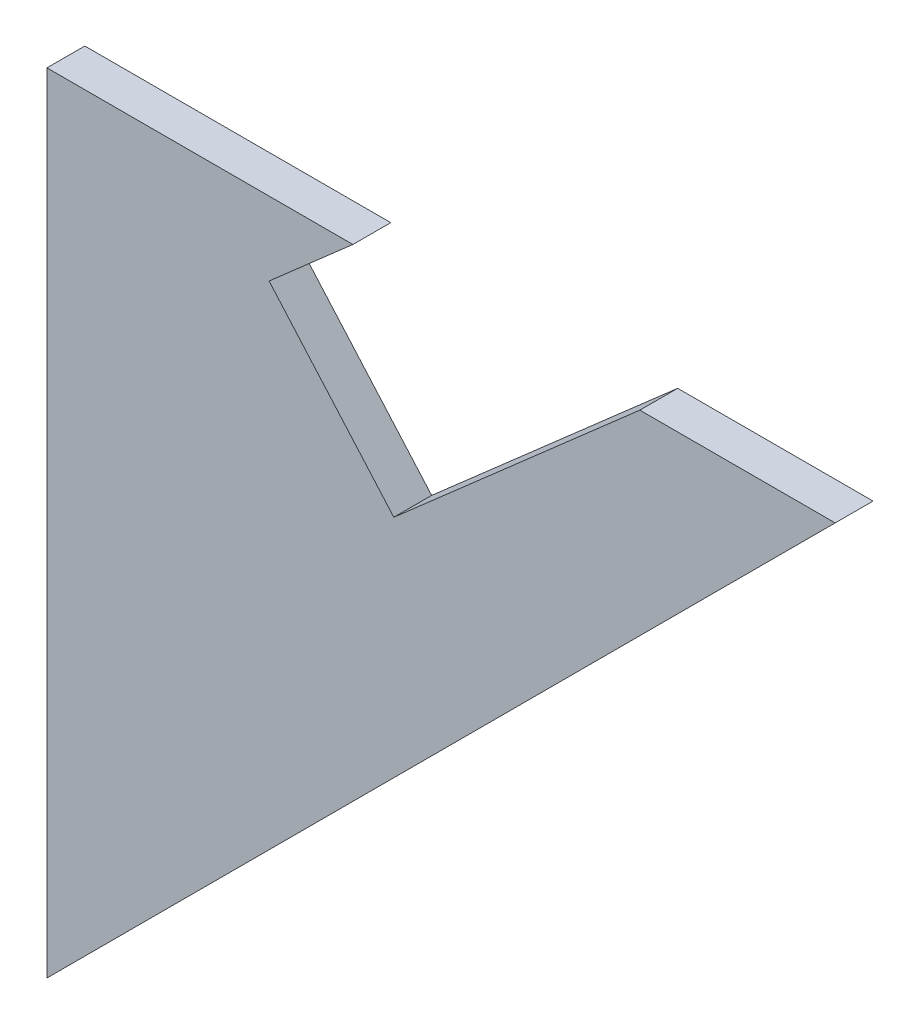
ISO-10303-21;
HEADER;
FILE_DESCRIPTION(('STEP AP214'),'2;1');
FILE_NAME('part.step','',(''),(''),'','','');
FILE_SCHEMA(('AUTOMOTIVE_DESIGN { 1 0 10303 214 1 1 1 1 }'));
ENDSEC;
DATA;
#1=APPLICATION_CONTEXT('core data for automotive mechanical design processes');
#2=APPLICATION_PROTOCOL_DEFINITION('international standard','automotive_design',2000,#1);
#3=PRODUCT_CONTEXT('',#1,'mechanical');
#4=PRODUCT('Part','Part','',(#3));
#5=PRODUCT_RELATED_PRODUCT_CATEGORY('part','',(#4));
#6=PRODUCT_DEFINITION_FORMATION('','',#4);
#7=PRODUCT_DEFINITION_CONTEXT('part definition',#1,'design');
#8=PRODUCT_DEFINITION('design','',#6,#7);
#9=PRODUCT_DEFINITION_SHAPE('','',#8);
#10=(LENGTH_UNIT() NAMED_UNIT(*) SI_UNIT(.MILLI.,.METRE.));
#11=(NAMED_UNIT(*) PLANE_ANGLE_UNIT() SI_UNIT($,.RADIAN.));
#12=(NAMED_UNIT(*) SI_UNIT($,.STERADIAN.) SOLID_ANGLE_UNIT());
#13=UNCERTAINTY_MEASURE_WITH_UNIT(LENGTH_MEASURE(1.E-05),#10,'distance_accuracy_value','');
#14=(GEOMETRIC_REPRESENTATION_CONTEXT(3) GLOBAL_UNCERTAINTY_ASSIGNED_CONTEXT((#13)) GLOBAL_UNIT_ASSIGNED_CONTEXT((#10,
#11,#12)) REPRESENTATION_CONTEXT('',''));
#15=CARTESIAN_POINT('',(0.,0.,0.));
#16=DIRECTION('',(0.,0.,1.));
#17=DIRECTION('',(1.,0.,0.));
#18=AXIS2_PLACEMENT_3D('',#15,#16,#17);
#19=CARTESIAN_POINT('',(110.00351767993,56.562232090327,36.001));
#20=DIRECTION('',(0.751859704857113,0.659323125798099,0.));
#21=DIRECTION('',(0.,0.,-1.));
#22=AXIS2_PLACEMENT_3D('',#19,#20,#21);
#23=PLANE('',#22);
#24=DIRECTION('',(0.,0.,-1.));
#25=VECTOR('',#24,1.);
#26=CARTESIAN_POINT('',(70.442811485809,101.67531810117,36.001));
#27=LINE('',#26,#25);
#28=CARTESIAN_POINT('',(70.442811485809,101.67531810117,12.));
#29=VERTEX_POINT('',#28);
#30=CARTESIAN_POINT('',(70.442811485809,101.67531810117,0.));
#31=VERTEX_POINT('',#30);
#32=EDGE_CURVE('E26',#29,#31,#27,.T.);
#33=ORIENTED_EDGE('',*,*,#32,.F.);
#34=DIRECTION('',(0.659323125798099,-0.751859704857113,0.));
#35=VECTOR('',#34,1.);
#36=CARTESIAN_POINT('',(110.25032063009,56.280790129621,12.));
#37=LINE('',#36,#35);
#38=CARTESIAN_POINT('',(110.00351767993,56.562232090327,12.));
#39=VERTEX_POINT('',#38);
#40=EDGE_CURVE('E90',#29,#39,#37,.T.);
#41=ORIENTED_EDGE('',*,*,#40,.T.);
#42=DIRECTION('',(0.,0.,-1.));
#43=VECTOR('',#42,1.);
#44=CARTESIAN_POINT('',(110.00351767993,56.562232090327,36.001));
#45=LINE('',#44,#43);
#46=CARTESIAN_POINT('',(110.00351767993,56.562232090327,0.));
#47=VERTEX_POINT('',#46);
#48=EDGE_CURVE('E10',#39,#47,#45,.T.);
#49=ORIENTED_EDGE('',*,*,#48,.T.);
#50=DIRECTION('',(0.659323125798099,-0.751859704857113,0.));
#51=VECTOR('',#50,1.);
#52=CARTESIAN_POINT('',(110.25032063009,56.280790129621,0.));
#53=LINE('',#52,#51);
#54=EDGE_CURVE('E87',#31,#47,#53,.T.);
#55=ORIENTED_EDGE('',*,*,#54,.F.);
#56=EDGE_LOOP('',(#33,#41,#49,#55));
#57=FACE_BOUND('',#56,.T.);
#58=ADVANCED_FACE('F16',(#57),#23,.T.);
#59=CARTESIAN_POINT('',(110.00351767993,56.562232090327,36.001));
#60=DIRECTION('',(-0.659323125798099,0.751859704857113,0.));
#61=DIRECTION('',(0.,0.,1.));
#62=AXIS2_PLACEMENT_3D('',#59,#60,#61);
#63=PLANE('',#62);
#64=ORIENTED_EDGE('',*,*,#48,.F.);
#65=DIRECTION('',(0.751859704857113,0.659323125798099,0.));
#66=VECTOR('',#65,1.);
#67=CARTESIAN_POINT('',(98.94912971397,46.86838418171,12.));
#68=LINE('',#67,#66);
#69=CARTESIAN_POINT('',(188.04658634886,125.,12.));
#70=VERTEX_POINT('',#69);
#71=EDGE_CURVE('E132',#39,#70,#68,.T.);
#72=ORIENTED_EDGE('',*,*,#71,.T.);
#73=DIRECTION('',(0.,0.,1.));
#74=VECTOR('',#73,1.);
#75=CARTESIAN_POINT('',(188.04658634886,125.,18.0005));
#76=LINE('',#75,#74);
#77=CARTESIAN_POINT('',(188.04658634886,125.,0.));
#78=VERTEX_POINT('',#77);
#79=EDGE_CURVE('E97',#78,#70,#76,.T.);
#80=ORIENTED_EDGE('',*,*,#79,.F.);
#81=DIRECTION('',(0.751859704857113,0.659323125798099,0.));
#82=VECTOR('',#81,1.);
#83=CARTESIAN_POINT('',(98.94912971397,46.86838418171,0.));
#84=LINE('',#83,#82);
#85=EDGE_CURVE('E95',#47,#78,#84,.T.);
#86=ORIENTED_EDGE('',*,*,#85,.F.);
#87=EDGE_LOOP('',(#64,#72,#80,#86));
#88=FACE_BOUND('',#87,.T.);
#89=ADVANCED_FACE('F18',(#88),#63,.T.);
#90=CARTESIAN_POINT('',(70.442811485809,101.67531810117,36.001));
#91=DIRECTION('',(-0.659323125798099,0.751859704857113,0.));
#92=DIRECTION('',(0.,0.,1.));
#93=AXIS2_PLACEMENT_3D('',#90,#91,#92);
#94=PLANE('',#93);
#95=DIRECTION('',(0.751859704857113,0.659323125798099,0.));
#96=VECTOR('',#95,1.);
#97=CARTESIAN_POINT('',(59.388423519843,91.981470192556,0.));
#98=LINE('',#97,#96);
#99=CARTESIAN_POINT('',(97.041132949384,125.,0.));
#100=VERTEX_POINT('',#99);
#101=EDGE_CURVE('E105',#31,#100,#98,.T.);
#102=ORIENTED_EDGE('',*,*,#101,.T.);
#103=DIRECTION('',(0.,0.,1.));
#104=VECTOR('',#103,1.);
#105=CARTESIAN_POINT('',(97.041132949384,125.,18.0005));
#106=LINE('',#105,#104);
#107=CARTESIAN_POINT('',(97.041132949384,125.,12.));
#108=VERTEX_POINT('',#107);
#109=EDGE_CURVE('E112',#100,#108,#106,.T.);
#110=ORIENTED_EDGE('',*,*,#109,.T.);
#111=DIRECTION('',(0.751859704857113,0.659323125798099,0.));
#112=VECTOR('',#111,1.);
#113=CARTESIAN_POINT('',(59.388423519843,91.981470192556,12.));
#114=LINE('',#113,#112);
#115=EDGE_CURVE('E149',#29,#108,#114,.T.);
#116=ORIENTED_EDGE('',*,*,#115,.F.);
#117=ORIENTED_EDGE('',*,*,#32,.T.);
#118=EDGE_LOOP('',(#102,#110,#116,#117));
#119=FACE_BOUND('',#118,.T.);
#120=ADVANCED_FACE('F185',(#119),#94,.F.);
#121=CARTESIAN_POINT('',(0.,125.,0.));
#122=DIRECTION('',(0.,1.,0.));
#123=DIRECTION('',(1.,0.,0.));
#124=AXIS2_PLACEMENT_3D('',#121,#122,#123);
#125=PLANE('',#124);
#126=DIRECTION('',(1.,0.,0.));
#127=VECTOR('',#126,1.);
#128=CARTESIAN_POINT('',(0.,125.,0.));
#129=LINE('',#128,#127);
#130=CARTESIAN_POINT('',(250.,125.,0.));
#131=VERTEX_POINT('',#130);
#132=EDGE_CURVE('E101',#78,#131,#129,.T.);
#133=ORIENTED_EDGE('',*,*,#132,.F.);
#134=ORIENTED_EDGE('',*,*,#79,.T.);
#135=DIRECTION('',(1.,0.,0.));
#136=VECTOR('',#135,1.);
#137=CARTESIAN_POINT('',(0.,125.,12.));
#138=LINE('',#137,#136);
#139=CARTESIAN_POINT('',(250.,125.,12.));
#140=VERTEX_POINT('',#139);
#141=EDGE_CURVE('E135',#70,#140,#138,.T.);
#142=ORIENTED_EDGE('',*,*,#141,.T.);
#143=DIRECTION('',(0.,0.,1.));
#144=VECTOR('',#143,1.);
#145=CARTESIAN_POINT('',(250.,125.,0.));
#146=LINE('',#145,#144);
#147=EDGE_CURVE('E122',#131,#140,#146,.T.);
#148=ORIENTED_EDGE('',*,*,#147,.F.);
#149=EDGE_LOOP('',(#133,#134,#142,#148));
#150=FACE_BOUND('',#149,.T.);
#151=ADVANCED_FACE('F154',(#150),#125,.T.);
#152=CARTESIAN_POINT('',(88.388347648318,36.611652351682,12.));
#153=DIRECTION('',(0.,0.,-1.));
#154=DIRECTION('',(0.,-1.,0.));
#155=AXIS2_PLACEMENT_3D('',#152,#153,#154);
#156=PLANE('',#155);
#157=ORIENTED_EDGE('',*,*,#141,.F.);
#158=ORIENTED_EDGE('',*,*,#71,.F.);
#159=ORIENTED_EDGE('',*,*,#40,.F.);
#160=ORIENTED_EDGE('',*,*,#115,.T.);
#161=DIRECTION('',(1.,0.,0.));
#162=VECTOR('',#161,1.);
#163=CARTESIAN_POINT('',(0.,125.,12.));
#164=LINE('',#163,#162);
#165=CARTESIAN_POINT('',(0.,125.,12.));
#166=VERTEX_POINT('',#165);
#167=EDGE_CURVE('E130',#166,#108,#164,.T.);
#168=ORIENTED_EDGE('',*,*,#167,.F.);
#169=DIRECTION('',(0.,1.,0.));
#170=VECTOR('',#169,1.);
#171=CARTESIAN_POINT('',(0.,-125.,12.));
#172=LINE('',#171,#170);
#173=CARTESIAN_POINT('',(0.,-125.,12.));
#174=VERTEX_POINT('',#173);
#175=EDGE_CURVE('E116',#174,#166,#172,.T.);
#176=ORIENTED_EDGE('',*,*,#175,.F.);
#177=DIRECTION('',(-0.707106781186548,-0.707106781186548,0.));
#178=VECTOR('',#177,1.);
#179=CARTESIAN_POINT('',(250.,125.,12.));
#180=LINE('',#179,#178);
#181=EDGE_CURVE('E126',#140,#174,#180,.T.);
#182=ORIENTED_EDGE('',*,*,#181,.F.);
#183=EDGE_LOOP('',(#157,#158,#159,#160,#168,#176,#182));
#184=FACE_BOUND('',#183,.T.);
#185=ADVANCED_FACE('F159',(#184),#156,.F.);
#186=CARTESIAN_POINT('',(88.388347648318,36.611652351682,0.));
#187=DIRECTION('',(0.,0.,-1.));
#188=DIRECTION('',(0.,-1.,0.));
#189=AXIS2_PLACEMENT_3D('',#186,#187,#188);
#190=PLANE('',#189);
#191=DIRECTION('',(-0.707106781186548,-0.707106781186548,0.));
#192=VECTOR('',#191,1.);
#193=CARTESIAN_POINT('',(250.,125.,0.));
#194=LINE('',#193,#192);
#195=CARTESIAN_POINT('',(0.,-125.,0.));
#196=VERTEX_POINT('',#195);
#197=EDGE_CURVE('E131',#131,#196,#194,.T.);
#198=ORIENTED_EDGE('',*,*,#197,.T.);
#199=DIRECTION('',(0.,1.,0.));
#200=VECTOR('',#199,1.);
#201=CARTESIAN_POINT('',(0.,-125.,0.));
#202=LINE('',#201,#200);
#203=CARTESIAN_POINT('',(0.,125.,0.));
#204=VERTEX_POINT('',#203);
#205=EDGE_CURVE('E121',#196,#204,#202,.T.);
#206=ORIENTED_EDGE('',*,*,#205,.T.);
#207=DIRECTION('',(1.,0.,0.));
#208=VECTOR('',#207,1.);
#209=CARTESIAN_POINT('',(0.,125.,0.));
#210=LINE('',#209,#208);
#211=EDGE_CURVE('E127',#204,#100,#210,.T.);
#212=ORIENTED_EDGE('',*,*,#211,.T.);
#213=ORIENTED_EDGE('',*,*,#101,.F.);
#214=ORIENTED_EDGE('',*,*,#54,.T.);
#215=ORIENTED_EDGE('',*,*,#85,.T.);
#216=ORIENTED_EDGE('',*,*,#132,.T.);
#217=EDGE_LOOP('',(#198,#206,#212,#213,#214,#215,#216));
#218=FACE_BOUND('',#217,.T.);
#219=ADVANCED_FACE('F103',(#218),#190,.T.);
#220=CARTESIAN_POINT('',(0.,125.,0.));
#221=DIRECTION('',(0.,1.,0.));
#222=DIRECTION('',(1.,0.,0.));
#223=AXIS2_PLACEMENT_3D('',#220,#221,#222);
#224=PLANE('',#223);
#225=ORIENTED_EDGE('',*,*,#211,.F.);
#226=DIRECTION('',(0.,0.,1.));
#227=VECTOR('',#226,1.);
#228=CARTESIAN_POINT('',(0.,125.,0.));
#229=LINE('',#228,#227);
#230=EDGE_CURVE('E118',#204,#166,#229,.T.);
#231=ORIENTED_EDGE('',*,*,#230,.T.);
#232=ORIENTED_EDGE('',*,*,#167,.T.);
#233=ORIENTED_EDGE('',*,*,#109,.F.);
#234=EDGE_LOOP('',(#225,#231,#232,#233));
#235=FACE_BOUND('',#234,.T.);
#236=ADVANCED_FACE('F187',(#235),#224,.T.);
#237=CARTESIAN_POINT('',(250.,125.,0.));
#238=DIRECTION('',(0.707106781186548,-0.707106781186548,0.));
#239=DIRECTION('',(0.,0.,-1.));
#240=AXIS2_PLACEMENT_3D('',#237,#238,#239);
#241=PLANE('',#240);
#242=ORIENTED_EDGE('',*,*,#147,.T.);
#243=ORIENTED_EDGE('',*,*,#181,.T.);
#244=DIRECTION('',(0.,0.,1.));
#245=VECTOR('',#244,1.);
#246=CARTESIAN_POINT('',(0.,-125.,0.));
#247=LINE('',#246,#245);
#248=EDGE_CURVE('E169',#196,#174,#247,.T.);
#249=ORIENTED_EDGE('',*,*,#248,.F.);
#250=ORIENTED_EDGE('',*,*,#197,.F.);
#251=EDGE_LOOP('',(#242,#243,#249,#250));
#252=FACE_BOUND('',#251,.T.);
#253=ADVANCED_FACE('F168',(#252),#241,.T.);
#254=CARTESIAN_POINT('',(0.,-125.,0.));
#255=DIRECTION('',(-1.,0.,0.));
#256=DIRECTION('',(0.,0.,1.));
#257=AXIS2_PLACEMENT_3D('',#254,#255,#256);
#258=PLANE('',#257);
#259=ORIENTED_EDGE('',*,*,#248,.T.);
#260=ORIENTED_EDGE('',*,*,#175,.T.);
#261=ORIENTED_EDGE('',*,*,#230,.F.);
#262=ORIENTED_EDGE('',*,*,#205,.F.);
#263=EDGE_LOOP('',(#259,#260,#261,#262));
#264=FACE_BOUND('',#263,.T.);
#265=ADVANCED_FACE('F174',(#264),#258,.T.);
#266=CLOSED_SHELL('',(#58,#89,#120,#151,#185,#219,#236,#253,#265));
#267=MANIFOLD_SOLID_BREP('B1',#266);
#268=ADVANCED_BREP_SHAPE_REPRESENTATION('',(#18,#267),#14);
#269=SHAPE_DEFINITION_REPRESENTATION(#9,#268);
ENDSEC;
END-ISO-10303-21;
